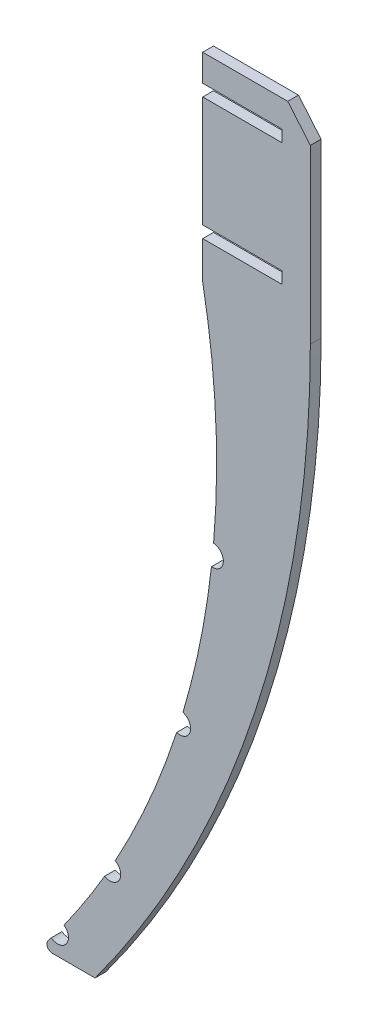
ISO-10303-21;
HEADER;
FILE_DESCRIPTION(('STEP AP214'),'2;1');
FILE_NAME('part.step','',(''),(''),'','','');
FILE_SCHEMA(('AUTOMOTIVE_DESIGN { 1 0 10303 214 1 1 1 1 }'));
ENDSEC;
DATA;
#1=APPLICATION_CONTEXT('core data for automotive mechanical design processes');
#2=APPLICATION_PROTOCOL_DEFINITION('international standard','automotive_design',2000,#1);
#3=PRODUCT_CONTEXT('',#1,'mechanical');
#4=PRODUCT('Part','Part','',(#3));
#5=PRODUCT_RELATED_PRODUCT_CATEGORY('part','',(#4));
#6=PRODUCT_DEFINITION_FORMATION('','',#4);
#7=PRODUCT_DEFINITION_CONTEXT('part definition',#1,'design');
#8=PRODUCT_DEFINITION('design','',#6,#7);
#9=PRODUCT_DEFINITION_SHAPE('','',#8);
#10=(LENGTH_UNIT() NAMED_UNIT(*) SI_UNIT(.MILLI.,.METRE.));
#11=(NAMED_UNIT(*) PLANE_ANGLE_UNIT() SI_UNIT($,.RADIAN.));
#12=(NAMED_UNIT(*) SI_UNIT($,.STERADIAN.) SOLID_ANGLE_UNIT());
#13=UNCERTAINTY_MEASURE_WITH_UNIT(LENGTH_MEASURE(1.E-05),#10,'distance_accuracy_value','');
#14=(GEOMETRIC_REPRESENTATION_CONTEXT(3) GLOBAL_UNCERTAINTY_ASSIGNED_CONTEXT((#13)) GLOBAL_UNIT_ASSIGNED_CONTEXT((#10,
#11,#12)) REPRESENTATION_CONTEXT('',''));
#15=CARTESIAN_POINT('',(0.,0.,0.));
#16=DIRECTION('',(0.,0.,1.));
#17=DIRECTION('',(1.,0.,0.));
#18=AXIS2_PLACEMENT_3D('',#15,#16,#17);
#19=CARTESIAN_POINT('',(-20.,-156.8,1.5));
#20=DIRECTION('',(0.,1.,0.));
#21=DIRECTION('',(1.,0.,0.));
#22=AXIS2_PLACEMENT_3D('',#19,#20,#21);
#23=PLANE('',#22);
#24=DIRECTION('',(0.,0.,1.));
#25=VECTOR('',#24,1.);
#26=CARTESIAN_POINT('',(-27.9577727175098,-156.8,1.5));
#27=LINE('',#26,#25);
#28=CARTESIAN_POINT('',(-27.9577727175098,-156.8,-0.5));
#29=VERTEX_POINT('',#28);
#30=CARTESIAN_POINT('',(-27.9577727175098,-156.8,1.5));
#31=VERTEX_POINT('',#30);
#32=EDGE_CURVE('E11',#29,#31,#27,.T.);
#33=ORIENTED_EDGE('',*,*,#32,.F.);
#34=DIRECTION('',(-1.,0.,0.));
#35=VECTOR('',#34,1.);
#36=CARTESIAN_POINT('',(-186.050000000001,-156.8,-0.5));
#37=LINE('',#36,#35);
#38=CARTESIAN_POINT('',(-20.,-156.8,-0.5));
#39=VERTEX_POINT('',#38);
#40=EDGE_CURVE('E149',#29,#39,#37,.F.);
#41=ORIENTED_EDGE('',*,*,#40,.T.);
#42=DIRECTION('',(0.,0.,1.));
#43=VECTOR('',#42,1.);
#44=CARTESIAN_POINT('',(-20.,-156.8,1.5));
#45=LINE('',#44,#43);
#46=CARTESIAN_POINT('',(-20.,-156.8,1.5));
#47=VERTEX_POINT('',#46);
#48=EDGE_CURVE('E44',#39,#47,#45,.T.);
#49=ORIENTED_EDGE('',*,*,#48,.T.);
#50=DIRECTION('',(1.,0.,0.));
#51=VECTOR('',#50,1.);
#52=CARTESIAN_POINT('',(-20.,-156.8,1.5));
#53=LINE('',#52,#51);
#54=EDGE_CURVE('E284',#31,#47,#53,.T.);
#55=ORIENTED_EDGE('',*,*,#54,.F.);
#56=EDGE_LOOP('',(#33,#41,#49,#55));
#57=FACE_BOUND('',#56,.T.);
#58=ADVANCED_FACE('F34',(#57),#23,.F.);
#59=CARTESIAN_POINT('',(-186.050000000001,-34.8,1.5));
#60=DIRECTION('',(0.,0.,1.));
#61=DIRECTION('',(1.,0.,0.));
#62=AXIS2_PLACEMENT_3D('',#59,#60,#61);
#63=CYLINDRICAL_SURFACE('',#62,206.05);
#64=ORIENTED_EDGE('',*,*,#48,.F.);
#65=CARTESIAN_POINT('',(-186.050000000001,-34.8,-0.5));
#66=DIRECTION('',(0.,0.,1.));
#67=DIRECTION('',(1.,0.,0.));
#68=AXIS2_PLACEMENT_3D('',#65,#66,#67);
#69=CIRCLE('',#68,206.05);
#70=CARTESIAN_POINT('',(19.9999999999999,-34.7999999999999,-0.5));
#71=VERTEX_POINT('',#70);
#72=EDGE_CURVE('E216',#39,#71,#69,.T.);
#73=ORIENTED_EDGE('',*,*,#72,.T.);
#74=DIRECTION('',(0.,0.,1.));
#75=VECTOR('',#74,1.);
#76=CARTESIAN_POINT('',(19.9999999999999,-34.7999999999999,1.5));
#77=LINE('',#76,#75);
#78=CARTESIAN_POINT('',(19.9999999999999,-34.7999999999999,1.5));
#79=VERTEX_POINT('',#78);
#80=EDGE_CURVE('E277',#71,#79,#77,.T.);
#81=ORIENTED_EDGE('',*,*,#80,.T.);
#82=CARTESIAN_POINT('',(-186.050000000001,-34.8,1.5));
#83=DIRECTION('',(0.,0.,1.));
#84=DIRECTION('',(-1.,0.,0.));
#85=AXIS2_PLACEMENT_3D('',#82,#83,#84);
#86=CIRCLE('',#85,206.05);
#87=EDGE_CURVE('E293',#47,#79,#86,.T.);
#88=ORIENTED_EDGE('',*,*,#87,.F.);
#89=EDGE_LOOP('',(#64,#73,#81,#88));
#90=FACE_BOUND('',#89,.T.);
#91=ADVANCED_FACE('F296',(#90),#63,.T.);
#92=CARTESIAN_POINT('',(19.9999999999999,2.2,1.5));
#93=DIRECTION('',(-1.,0.,0.));
#94=DIRECTION('',(0.,1.,0.));
#95=AXIS2_PLACEMENT_3D('',#92,#93,#94);
#96=PLANE('',#95);
#97=ORIENTED_EDGE('',*,*,#80,.F.);
#98=DIRECTION('',(0.,1.,0.));
#99=VECTOR('',#98,1.);
#100=CARTESIAN_POINT('',(19.9999999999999,-34.8,-0.5));
#101=LINE('',#100,#99);
#102=CARTESIAN_POINT('',(19.9999999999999,-2.8,-0.5));
#103=VERTEX_POINT('',#102);
#104=EDGE_CURVE('E213',#71,#103,#101,.T.);
#105=ORIENTED_EDGE('',*,*,#104,.T.);
#106=DIRECTION('',(0.,0.,1.));
#107=VECTOR('',#106,1.);
#108=CARTESIAN_POINT('',(19.9999999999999,-2.8,1.5));
#109=LINE('',#108,#107);
#110=CARTESIAN_POINT('',(19.9999999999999,-2.8,1.5));
#111=VERTEX_POINT('',#110);
#112=EDGE_CURVE('E274',#103,#111,#109,.T.);
#113=ORIENTED_EDGE('',*,*,#112,.T.);
#114=DIRECTION('',(0.,1.,0.));
#115=VECTOR('',#114,1.);
#116=CARTESIAN_POINT('',(19.9999999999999,2.2,1.5));
#117=LINE('',#116,#115);
#118=EDGE_CURVE('E297',#79,#111,#117,.T.);
#119=ORIENTED_EDGE('',*,*,#118,.F.);
#120=EDGE_LOOP('',(#97,#105,#113,#119));
#121=FACE_BOUND('',#120,.T.);
#122=ADVANCED_FACE('F464',(#121),#96,.F.);
#123=CARTESIAN_POINT('',(15.8045018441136,2.2,1.5));
#124=DIRECTION('',(0.76604444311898,0.642787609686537,0.));
#125=DIRECTION('',(0.642787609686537,-0.76604444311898,0.));
#126=AXIS2_PLACEMENT_3D('',#123,#124,#125);
#127=PLANE('',#126);
#128=ORIENTED_EDGE('',*,*,#112,.F.);
#129=DIRECTION('',(0.642787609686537,-0.76604444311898,0.));
#130=VECTOR('',#129,1.);
#131=CARTESIAN_POINT('',(15.8045018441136,2.2,-0.5));
#132=LINE('',#131,#130);
#133=CARTESIAN_POINT('',(15.8045018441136,2.2,-0.5));
#134=VERTEX_POINT('',#133);
#135=EDGE_CURVE('E210',#103,#134,#132,.F.);
#136=ORIENTED_EDGE('',*,*,#135,.T.);
#137=DIRECTION('',(0.,0.,1.));
#138=VECTOR('',#137,1.);
#139=CARTESIAN_POINT('',(15.8045018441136,2.2,1.5));
#140=LINE('',#139,#138);
#141=CARTESIAN_POINT('',(15.8045018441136,2.2,1.5));
#142=VERTEX_POINT('',#141);
#143=EDGE_CURVE('E271',#134,#142,#140,.T.);
#144=ORIENTED_EDGE('',*,*,#143,.T.);
#145=DIRECTION('',(0.642787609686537,-0.76604444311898,0.));
#146=VECTOR('',#145,1.);
#147=CARTESIAN_POINT('',(15.8045018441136,2.2,1.5));
#148=LINE('',#147,#146);
#149=EDGE_CURVE('E299',#111,#142,#148,.F.);
#150=ORIENTED_EDGE('',*,*,#149,.F.);
#151=EDGE_LOOP('',(#128,#136,#144,#150));
#152=FACE_BOUND('',#151,.T.);
#153=ADVANCED_FACE('F460',(#152),#127,.T.);
#154=CARTESIAN_POINT('',(0.,2.2,1.5));
#155=DIRECTION('',(0.,-1.,0.));
#156=DIRECTION('',(-1.,0.,0.));
#157=AXIS2_PLACEMENT_3D('',#154,#155,#156);
#158=PLANE('',#157);
#159=ORIENTED_EDGE('',*,*,#143,.F.);
#160=DIRECTION('',(-1.,0.,0.));
#161=VECTOR('',#160,1.);
#162=CARTESIAN_POINT('',(-186.050000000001,2.2,-0.5));
#163=LINE('',#162,#161);
#164=CARTESIAN_POINT('',(0.,2.2,-0.5));
#165=VERTEX_POINT('',#164);
#166=EDGE_CURVE('E207',#134,#165,#163,.T.);
#167=ORIENTED_EDGE('',*,*,#166,.T.);
#168=DIRECTION('',(0.,0.,1.));
#169=VECTOR('',#168,1.);
#170=CARTESIAN_POINT('',(0.,2.2,1.5));
#171=LINE('',#170,#169);
#172=CARTESIAN_POINT('',(0.,2.2,1.5));
#173=VERTEX_POINT('',#172);
#174=EDGE_CURVE('E268',#165,#173,#171,.T.);
#175=ORIENTED_EDGE('',*,*,#174,.T.);
#176=DIRECTION('',(-1.,0.,0.));
#177=VECTOR('',#176,1.);
#178=CARTESIAN_POINT('',(0.,2.2,1.5));
#179=LINE('',#178,#177);
#180=EDGE_CURVE('E305',#142,#173,#179,.T.);
#181=ORIENTED_EDGE('',*,*,#180,.F.);
#182=EDGE_LOOP('',(#159,#167,#175,#181));
#183=FACE_BOUND('',#182,.T.);
#184=ADVANCED_FACE('F457',(#183),#158,.F.);
#185=CARTESIAN_POINT('',(0.,-2.8,1.5));
#186=DIRECTION('',(1.,0.,0.));
#187=DIRECTION('',(0.,-1.,0.));
#188=AXIS2_PLACEMENT_3D('',#185,#186,#187);
#189=PLANE('',#188);
#190=ORIENTED_EDGE('',*,*,#174,.F.);
#191=DIRECTION('',(0.,1.,0.));
#192=VECTOR('',#191,1.);
#193=CARTESIAN_POINT('',(0.,-34.8,-0.5));
#194=LINE('',#193,#192);
#195=CARTESIAN_POINT('',(0.,-2.8,-0.5));
#196=VERTEX_POINT('',#195);
#197=EDGE_CURVE('E204',#165,#196,#194,.F.);
#198=ORIENTED_EDGE('',*,*,#197,.T.);
#199=DIRECTION('',(0.,0.,1.));
#200=VECTOR('',#199,1.);
#201=CARTESIAN_POINT('',(0.,-2.8,1.5));
#202=LINE('',#201,#200);
#203=CARTESIAN_POINT('',(0.,-2.8,1.5));
#204=VERTEX_POINT('',#203);
#205=EDGE_CURVE('E265',#196,#204,#202,.T.);
#206=ORIENTED_EDGE('',*,*,#205,.T.);
#207=DIRECTION('',(0.,-1.,0.));
#208=VECTOR('',#207,1.);
#209=CARTESIAN_POINT('',(0.,-2.8,1.5));
#210=LINE('',#209,#208);
#211=EDGE_CURVE('E308',#173,#204,#210,.T.);
#212=ORIENTED_EDGE('',*,*,#211,.F.);
#213=EDGE_LOOP('',(#190,#198,#206,#212));
#214=FACE_BOUND('',#213,.T.);
#215=ADVANCED_FACE('F454',(#214),#189,.F.);
#216=CARTESIAN_POINT('',(0.,-2.8,1.5));
#217=DIRECTION('',(0.,1.,0.));
#218=DIRECTION('',(1.,0.,0.));
#219=AXIS2_PLACEMENT_3D('',#216,#217,#218);
#220=PLANE('',#219);
#221=ORIENTED_EDGE('',*,*,#205,.F.);
#222=DIRECTION('',(-1.,0.,0.));
#223=VECTOR('',#222,1.);
#224=CARTESIAN_POINT('',(-186.050000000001,-2.8,-0.5));
#225=LINE('',#224,#223);
#226=CARTESIAN_POINT('',(14.77,-2.8,-0.5));
#227=VERTEX_POINT('',#226);
#228=EDGE_CURVE('E201',#196,#227,#225,.F.);
#229=ORIENTED_EDGE('',*,*,#228,.T.);
#230=DIRECTION('',(0.,0.,1.));
#231=VECTOR('',#230,1.);
#232=CARTESIAN_POINT('',(14.77,-2.8,1.5));
#233=LINE('',#232,#231);
#234=CARTESIAN_POINT('',(14.77,-2.8,1.5));
#235=VERTEX_POINT('',#234);
#236=EDGE_CURVE('E262',#227,#235,#233,.T.);
#237=ORIENTED_EDGE('',*,*,#236,.T.);
#238=DIRECTION('',(1.,0.,0.));
#239=VECTOR('',#238,1.);
#240=CARTESIAN_POINT('',(0.,-2.8,1.5));
#241=LINE('',#240,#239);
#242=EDGE_CURVE('E311',#204,#235,#241,.T.);
#243=ORIENTED_EDGE('',*,*,#242,.F.);
#244=EDGE_LOOP('',(#221,#229,#237,#243));
#245=FACE_BOUND('',#244,.T.);
#246=ADVANCED_FACE('F449',(#245),#220,.F.);
#247=CARTESIAN_POINT('',(14.77,-2.8,1.5));
#248=DIRECTION('',(1.,0.,0.));
#249=DIRECTION('',(0.,-1.,0.));
#250=AXIS2_PLACEMENT_3D('',#247,#248,#249);
#251=PLANE('',#250);
#252=ORIENTED_EDGE('',*,*,#236,.F.);
#253=DIRECTION('',(0.,1.,0.));
#254=VECTOR('',#253,1.);
#255=CARTESIAN_POINT('',(14.77,-34.8,-0.5));
#256=LINE('',#255,#254);
#257=CARTESIAN_POINT('',(14.77,-5.,-0.5));
#258=VERTEX_POINT('',#257);
#259=EDGE_CURVE('E198',#227,#258,#256,.F.);
#260=ORIENTED_EDGE('',*,*,#259,.T.);
#261=DIRECTION('',(0.,0.,1.));
#262=VECTOR('',#261,1.);
#263=CARTESIAN_POINT('',(14.77,-5.,1.5));
#264=LINE('',#263,#262);
#265=CARTESIAN_POINT('',(14.77,-5.,1.5));
#266=VERTEX_POINT('',#265);
#267=EDGE_CURVE('E259',#258,#266,#264,.T.);
#268=ORIENTED_EDGE('',*,*,#267,.T.);
#269=DIRECTION('',(0.,-1.,0.));
#270=VECTOR('',#269,1.);
#271=CARTESIAN_POINT('',(14.77,-2.8,1.5));
#272=LINE('',#271,#270);
#273=EDGE_CURVE('E314',#235,#266,#272,.T.);
#274=ORIENTED_EDGE('',*,*,#273,.F.);
#275=EDGE_LOOP('',(#252,#260,#268,#274));
#276=FACE_BOUND('',#275,.T.);
#277=ADVANCED_FACE('F445',(#276),#251,.F.);
#278=CARTESIAN_POINT('',(0.,-5.,1.5));
#279=DIRECTION('',(0.,-1.,0.));
#280=DIRECTION('',(-1.,0.,0.));
#281=AXIS2_PLACEMENT_3D('',#278,#279,#280);
#282=PLANE('',#281);
#283=ORIENTED_EDGE('',*,*,#267,.F.);
#284=DIRECTION('',(-1.,0.,0.));
#285=VECTOR('',#284,1.);
#286=CARTESIAN_POINT('',(-186.050000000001,-5.,-0.5));
#287=LINE('',#286,#285);
#288=CARTESIAN_POINT('',(0.,-5.,-0.5));
#289=VERTEX_POINT('',#288);
#290=EDGE_CURVE('E195',#258,#289,#287,.T.);
#291=ORIENTED_EDGE('',*,*,#290,.T.);
#292=DIRECTION('',(0.,0.,1.));
#293=VECTOR('',#292,1.);
#294=CARTESIAN_POINT('',(0.,-5.,1.5));
#295=LINE('',#294,#293);
#296=CARTESIAN_POINT('',(0.,-5.,1.5));
#297=VERTEX_POINT('',#296);
#298=EDGE_CURVE('E256',#289,#297,#295,.T.);
#299=ORIENTED_EDGE('',*,*,#298,.T.);
#300=DIRECTION('',(-1.,0.,0.));
#301=VECTOR('',#300,1.);
#302=CARTESIAN_POINT('',(0.,-5.,1.5));
#303=LINE('',#302,#301);
#304=EDGE_CURVE('E317',#266,#297,#303,.T.);
#305=ORIENTED_EDGE('',*,*,#304,.F.);
#306=EDGE_LOOP('',(#283,#291,#299,#305));
#307=FACE_BOUND('',#306,.T.);
#308=ADVANCED_FACE('F442',(#307),#282,.F.);
#309=CARTESIAN_POINT('',(0.,-5.,1.5));
#310=DIRECTION('',(1.,0.,0.));
#311=DIRECTION('',(0.,-1.,0.));
#312=AXIS2_PLACEMENT_3D('',#309,#310,#311);
#313=PLANE('',#312);
#314=ORIENTED_EDGE('',*,*,#298,.F.);
#315=DIRECTION('',(0.,1.,0.));
#316=VECTOR('',#315,1.);
#317=CARTESIAN_POINT('',(0.,-34.8,-0.5));
#318=LINE('',#317,#316);
#319=CARTESIAN_POINT('',(0.,-25.6,-0.5));
#320=VERTEX_POINT('',#319);
#321=EDGE_CURVE('E192',#289,#320,#318,.F.);
#322=ORIENTED_EDGE('',*,*,#321,.T.);
#323=DIRECTION('',(0.,0.,1.));
#324=VECTOR('',#323,1.);
#325=CARTESIAN_POINT('',(0.,-25.6,1.5));
#326=LINE('',#325,#324);
#327=CARTESIAN_POINT('',(0.,-25.6,1.5));
#328=VERTEX_POINT('',#327);
#329=EDGE_CURVE('E253',#320,#328,#326,.T.);
#330=ORIENTED_EDGE('',*,*,#329,.T.);
#331=DIRECTION('',(0.,-1.,0.));
#332=VECTOR('',#331,1.);
#333=CARTESIAN_POINT('',(0.,-5.,1.5));
#334=LINE('',#333,#332);
#335=EDGE_CURVE('E320',#297,#328,#334,.T.);
#336=ORIENTED_EDGE('',*,*,#335,.F.);
#337=EDGE_LOOP('',(#314,#322,#330,#336));
#338=FACE_BOUND('',#337,.T.);
#339=ADVANCED_FACE('F437',(#338),#313,.F.);
#340=CARTESIAN_POINT('',(0.,-25.6,1.5));
#341=DIRECTION('',(0.,1.,0.));
#342=DIRECTION('',(1.,0.,0.));
#343=AXIS2_PLACEMENT_3D('',#340,#341,#342);
#344=PLANE('',#343);
#345=ORIENTED_EDGE('',*,*,#329,.F.);
#346=DIRECTION('',(-1.,0.,0.));
#347=VECTOR('',#346,1.);
#348=CARTESIAN_POINT('',(-186.050000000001,-25.6,-0.5));
#349=LINE('',#348,#347);
#350=CARTESIAN_POINT('',(14.77,-25.6,-0.5));
#351=VERTEX_POINT('',#350);
#352=EDGE_CURVE('E189',#320,#351,#349,.F.);
#353=ORIENTED_EDGE('',*,*,#352,.T.);
#354=DIRECTION('',(0.,0.,1.));
#355=VECTOR('',#354,1.);
#356=CARTESIAN_POINT('',(14.77,-25.6,1.5));
#357=LINE('',#356,#355);
#358=CARTESIAN_POINT('',(14.77,-25.6,1.5));
#359=VERTEX_POINT('',#358);
#360=EDGE_CURVE('E250',#351,#359,#357,.T.);
#361=ORIENTED_EDGE('',*,*,#360,.T.);
#362=DIRECTION('',(1.,0.,0.));
#363=VECTOR('',#362,1.);
#364=CARTESIAN_POINT('',(0.,-25.6,1.5));
#365=LINE('',#364,#363);
#366=EDGE_CURVE('E323',#328,#359,#365,.T.);
#367=ORIENTED_EDGE('',*,*,#366,.F.);
#368=EDGE_LOOP('',(#345,#353,#361,#367));
#369=FACE_BOUND('',#368,.T.);
#370=ADVANCED_FACE('F433',(#369),#344,.F.);
#371=CARTESIAN_POINT('',(14.77,-25.6,1.5));
#372=DIRECTION('',(1.,0.,0.));
#373=DIRECTION('',(0.,-1.,0.));
#374=AXIS2_PLACEMENT_3D('',#371,#372,#373);
#375=PLANE('',#374);
#376=ORIENTED_EDGE('',*,*,#360,.F.);
#377=DIRECTION('',(0.,1.,0.));
#378=VECTOR('',#377,1.);
#379=CARTESIAN_POINT('',(14.77,-34.8,-0.5));
#380=LINE('',#379,#378);
#381=CARTESIAN_POINT('',(14.77,-27.8,-0.5));
#382=VERTEX_POINT('',#381);
#383=EDGE_CURVE('E186',#351,#382,#380,.F.);
#384=ORIENTED_EDGE('',*,*,#383,.T.);
#385=DIRECTION('',(0.,0.,1.));
#386=VECTOR('',#385,1.);
#387=CARTESIAN_POINT('',(14.77,-27.8,1.5));
#388=LINE('',#387,#386);
#389=CARTESIAN_POINT('',(14.77,-27.8,1.5));
#390=VERTEX_POINT('',#389);
#391=EDGE_CURVE('E247',#382,#390,#388,.T.);
#392=ORIENTED_EDGE('',*,*,#391,.T.);
#393=DIRECTION('',(0.,-1.,0.));
#394=VECTOR('',#393,1.);
#395=CARTESIAN_POINT('',(14.77,-25.6,1.5));
#396=LINE('',#395,#394);
#397=EDGE_CURVE('E326',#359,#390,#396,.T.);
#398=ORIENTED_EDGE('',*,*,#397,.F.);
#399=EDGE_LOOP('',(#376,#384,#392,#398));
#400=FACE_BOUND('',#399,.T.);
#401=ADVANCED_FACE('F430',(#400),#375,.F.);
#402=CARTESIAN_POINT('',(0.,-27.8,1.5));
#403=DIRECTION('',(0.,-1.,0.));
#404=DIRECTION('',(-1.,0.,0.));
#405=AXIS2_PLACEMENT_3D('',#402,#403,#404);
#406=PLANE('',#405);
#407=ORIENTED_EDGE('',*,*,#391,.F.);
#408=DIRECTION('',(-1.,0.,0.));
#409=VECTOR('',#408,1.);
#410=CARTESIAN_POINT('',(-186.050000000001,-27.8,-0.5));
#411=LINE('',#410,#409);
#412=CARTESIAN_POINT('',(0.,-27.8,-0.5));
#413=VERTEX_POINT('',#412);
#414=EDGE_CURVE('E183',#382,#413,#411,.T.);
#415=ORIENTED_EDGE('',*,*,#414,.T.);
#416=DIRECTION('',(0.,0.,1.));
#417=VECTOR('',#416,1.);
#418=CARTESIAN_POINT('',(0.,-27.8,1.5));
#419=LINE('',#418,#417);
#420=CARTESIAN_POINT('',(0.,-27.8,1.5));
#421=VERTEX_POINT('',#420);
#422=EDGE_CURVE('E244',#413,#421,#419,.T.);
#423=ORIENTED_EDGE('',*,*,#422,.T.);
#424=DIRECTION('',(-1.,0.,0.));
#425=VECTOR('',#424,1.);
#426=CARTESIAN_POINT('',(0.,-27.8,1.5));
#427=LINE('',#426,#425);
#428=EDGE_CURVE('E329',#390,#421,#427,.T.);
#429=ORIENTED_EDGE('',*,*,#428,.F.);
#430=EDGE_LOOP('',(#407,#415,#423,#429));
#431=FACE_BOUND('',#430,.T.);
#432=ADVANCED_FACE('F425',(#431),#406,.F.);
#433=CARTESIAN_POINT('',(0.,-27.8,1.5));
#434=DIRECTION('',(1.,0.,0.));
#435=DIRECTION('',(0.,-1.,0.));
#436=AXIS2_PLACEMENT_3D('',#433,#434,#435);
#437=PLANE('',#436);
#438=ORIENTED_EDGE('',*,*,#422,.F.);
#439=DIRECTION('',(0.,1.,0.));
#440=VECTOR('',#439,1.);
#441=CARTESIAN_POINT('',(0.,-34.8,-0.5));
#442=LINE('',#441,#440);
#443=CARTESIAN_POINT('',(0.,-34.8,-0.5));
#444=VERTEX_POINT('',#443);
#445=EDGE_CURVE('E180',#413,#444,#442,.F.);
#446=ORIENTED_EDGE('',*,*,#445,.T.);
#447=DIRECTION('',(0.,0.,1.));
#448=VECTOR('',#447,1.);
#449=CARTESIAN_POINT('',(0.,-34.8,1.5));
#450=LINE('',#449,#448);
#451=CARTESIAN_POINT('',(0.,-34.8,1.5));
#452=VERTEX_POINT('',#451);
#453=EDGE_CURVE('E241',#444,#452,#450,.T.);
#454=ORIENTED_EDGE('',*,*,#453,.T.);
#455=DIRECTION('',(0.,-1.,0.));
#456=VECTOR('',#455,1.);
#457=CARTESIAN_POINT('',(0.,-27.8,1.5));
#458=LINE('',#457,#456);
#459=EDGE_CURVE('E332',#421,#452,#458,.T.);
#460=ORIENTED_EDGE('',*,*,#459,.F.);
#461=EDGE_LOOP('',(#438,#446,#454,#460));
#462=FACE_BOUND('',#461,.T.);
#463=ADVANCED_FACE('F421',(#462),#437,.F.);
#464=CARTESIAN_POINT('',(-149.53282032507,-62.7181589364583,1.5));
#465=DIRECTION('',(0.,0.,-1.));
#466=DIRECTION('',(-1.,0.,0.));
#467=AXIS2_PLACEMENT_3D('',#464,#465,#466);
#468=CYLINDRICAL_SURFACE('',#467,152.11669189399);
#469=ORIENTED_EDGE('',*,*,#453,.F.);
#470=CARTESIAN_POINT('',(-149.53282032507,-62.7181589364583,-0.5));
#471=DIRECTION('',(0.,0.,-1.));
#472=DIRECTION('',(-1.,0.,0.));
#473=AXIS2_PLACEMENT_3D('',#470,#471,#472);
#474=CIRCLE('',#473,152.11669189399);
#475=CARTESIAN_POINT('',(2.01957480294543,-75.8085937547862,-0.5));
#476=VERTEX_POINT('',#475);
#477=EDGE_CURVE('E177',#444,#476,#474,.T.);
#478=ORIENTED_EDGE('',*,*,#477,.T.);
#479=DIRECTION('',(0.,0.,1.));
#480=VECTOR('',#479,1.);
#481=CARTESIAN_POINT('',(2.01957480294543,-75.8085937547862,1.5));
#482=LINE('',#481,#480);
#483=CARTESIAN_POINT('',(2.01957480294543,-75.8085937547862,1.5));
#484=VERTEX_POINT('',#483);
#485=EDGE_CURVE('E238',#476,#484,#482,.T.);
#486=ORIENTED_EDGE('',*,*,#485,.T.);
#487=CARTESIAN_POINT('',(-149.53282032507,-62.7181589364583,1.5));
#488=DIRECTION('',(0.,0.,-1.));
#489=DIRECTION('',(-1.,0.,0.));
#490=AXIS2_PLACEMENT_3D('',#487,#488,#489);
#491=CIRCLE('',#490,152.11669189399);
#492=EDGE_CURVE('E335',#452,#484,#491,.T.);
#493=ORIENTED_EDGE('',*,*,#492,.F.);
#494=EDGE_LOOP('',(#469,#478,#486,#493));
#495=FACE_BOUND('',#494,.T.);
#496=ADVANCED_FACE('F418',(#495),#468,.F.);
#497=CARTESIAN_POINT('',(1.83436906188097,-77.8,1.5));
#498=DIRECTION('',(0.,0.,1.));
#499=DIRECTION('',(1.,0.,0.));
#500=AXIS2_PLACEMENT_3D('',#497,#498,#499);
#501=CYLINDRICAL_SURFACE('',#500,2.);
#502=ORIENTED_EDGE('',*,*,#485,.F.);
#503=CARTESIAN_POINT('',(1.83436906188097,-77.8,-0.5));
#504=DIRECTION('',(0.,0.,1.));
#505=DIRECTION('',(1.,0.,0.));
#506=AXIS2_PLACEMENT_3D('',#503,#504,#505);
#507=CIRCLE('',#506,2.);
#508=CARTESIAN_POINT('',(1.62299728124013,-79.7887991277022,-0.5));
#509=VERTEX_POINT('',#508);
#510=EDGE_CURVE('E174',#509,#476,#507,.T.);
#511=ORIENTED_EDGE('',*,*,#510,.F.);
#512=DIRECTION('',(0.,0.,1.));
#513=VECTOR('',#512,1.);
#514=CARTESIAN_POINT('',(1.62299728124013,-79.7887991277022,1.5));
#515=LINE('',#514,#513);
#516=CARTESIAN_POINT('',(1.62299728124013,-79.7887991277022,1.5));
#517=VERTEX_POINT('',#516);
#518=EDGE_CURVE('E235',#509,#517,#515,.T.);
#519=ORIENTED_EDGE('',*,*,#518,.T.);
#520=CARTESIAN_POINT('',(1.83436906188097,-77.8,1.5));
#521=DIRECTION('',(0.,0.,1.));
#522=DIRECTION('',(1.,0.,0.));
#523=AXIS2_PLACEMENT_3D('',#520,#521,#522);
#524=CIRCLE('',#523,2.);
#525=EDGE_CURVE('E336',#517,#484,#524,.T.);
#526=ORIENTED_EDGE('',*,*,#525,.T.);
#527=EDGE_LOOP('',(#502,#511,#519,#526));
#528=FACE_BOUND('',#527,.T.);
#529=ADVANCED_FACE('F414',(#528),#501,.F.);
#530=ORIENTED_EDGE('',*,*,#518,.F.);
#531=CARTESIAN_POINT('',(-149.53282032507,-62.7181589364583,-0.5));
#532=DIRECTION('',(0.,0.,-1.));
#533=DIRECTION('',(-1.,0.,0.));
#534=AXIS2_PLACEMENT_3D('',#531,#532,#533);
#535=CIRCLE('',#534,152.11669189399);
#536=CARTESIAN_POINT('',(-3.66978203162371,-105.885994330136,-0.5));
#537=VERTEX_POINT('',#536);
#538=EDGE_CURVE('E171',#509,#537,#535,.T.);
#539=ORIENTED_EDGE('',*,*,#538,.T.);
#540=DIRECTION('',(0.,0.,1.));
#541=VECTOR('',#540,1.);
#542=CARTESIAN_POINT('',(-3.66978203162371,-105.885994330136,1.5));
#543=LINE('',#542,#541);
#544=CARTESIAN_POINT('',(-3.66978203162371,-105.885994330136,1.5));
#545=VERTEX_POINT('',#544);
#546=EDGE_CURVE('E232',#537,#545,#543,.T.);
#547=ORIENTED_EDGE('',*,*,#546,.T.);
#548=EDGE_CURVE('E339',#517,#545,#491,.T.);
#549=ORIENTED_EDGE('',*,*,#548,.F.);
#550=EDGE_LOOP('',(#530,#539,#547,#549));
#551=FACE_BOUND('',#550,.T.);
#552=ADVANCED_FACE('F412',(#551),#468,.F.);
#553=CARTESIAN_POINT('',(-4.24993916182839,-107.8,1.5));
#554=DIRECTION('',(0.,0.,1.));
#555=DIRECTION('',(1.,0.,0.));
#556=AXIS2_PLACEMENT_3D('',#553,#554,#555);
#557=CYLINDRICAL_SURFACE('',#556,2.);
#558=ORIENTED_EDGE('',*,*,#546,.F.);
#559=CARTESIAN_POINT('',(-4.24993916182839,-107.8,-0.5));
#560=DIRECTION('',(0.,0.,1.));
#561=DIRECTION('',(1.,0.,0.));
#562=AXIS2_PLACEMENT_3D('',#559,#560,#561);
#563=CIRCLE('',#562,2.);
#564=CARTESIAN_POINT('',(-4.85521056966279,-109.706212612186,-0.5));
#565=VERTEX_POINT('',#564);
#566=EDGE_CURVE('E168',#565,#537,#563,.T.);
#567=ORIENTED_EDGE('',*,*,#566,.F.);
#568=DIRECTION('',(0.,0.,1.));
#569=VECTOR('',#568,1.);
#570=CARTESIAN_POINT('',(-4.85521056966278,-109.706212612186,1.5));
#571=LINE('',#570,#569);
#572=CARTESIAN_POINT('',(-4.85521056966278,-109.706212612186,1.5));
#573=VERTEX_POINT('',#572);
#574=EDGE_CURVE('E229',#565,#573,#571,.T.);
#575=ORIENTED_EDGE('',*,*,#574,.T.);
#576=CARTESIAN_POINT('',(-4.24993916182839,-107.8,1.5));
#577=DIRECTION('',(0.,0.,1.));
#578=DIRECTION('',(1.,0.,0.));
#579=AXIS2_PLACEMENT_3D('',#576,#577,#578);
#580=CIRCLE('',#579,2.);
#581=EDGE_CURVE('E340',#573,#545,#580,.T.);
#582=ORIENTED_EDGE('',*,*,#581,.T.);
#583=EDGE_LOOP('',(#558,#567,#575,#582));
#584=FACE_BOUND('',#583,.T.);
#585=ADVANCED_FACE('F408',(#584),#557,.F.);
#586=ORIENTED_EDGE('',*,*,#574,.F.);
#587=CARTESIAN_POINT('',(-149.53282032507,-62.7181589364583,-0.5));
#588=DIRECTION('',(0.,0.,-1.));
#589=DIRECTION('',(-1.,0.,0.));
#590=AXIS2_PLACEMENT_3D('',#587,#588,#589);
#591=CIRCLE('',#590,152.11669189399);
#592=CARTESIAN_POINT('',(-16.2612154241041,-136.054147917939,-0.5));
#593=VERTEX_POINT('',#592);
#594=EDGE_CURVE('E165',#565,#593,#591,.T.);
#595=ORIENTED_EDGE('',*,*,#594,.T.);
#596=DIRECTION('',(0.,0.,1.));
#597=VECTOR('',#596,1.);
#598=CARTESIAN_POINT('',(-16.2612154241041,-136.054147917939,1.5));
#599=LINE('',#598,#597);
#600=CARTESIAN_POINT('',(-16.2612154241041,-136.054147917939,1.5));
#601=VERTEX_POINT('',#600);
#602=EDGE_CURVE('E226',#593,#601,#599,.T.);
#603=ORIENTED_EDGE('',*,*,#602,.T.);
#604=EDGE_CURVE('E342',#573,#601,#491,.T.);
#605=ORIENTED_EDGE('',*,*,#604,.F.);
#606=EDGE_LOOP('',(#586,#595,#603,#605));
#607=FACE_BOUND('',#606,.T.);
#608=ADVANCED_FACE('F406',(#607),#468,.F.);
#609=CARTESIAN_POINT('',(-17.2369205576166,-137.8,1.5));
#610=DIRECTION('',(0.,0.,1.));
#611=DIRECTION('',(1.,0.,0.));
#612=AXIS2_PLACEMENT_3D('',#609,#610,#611);
#613=CYLINDRICAL_SURFACE('',#612,2.);
#614=ORIENTED_EDGE('',*,*,#602,.F.);
#615=CARTESIAN_POINT('',(-17.2369205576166,-137.8,-0.5));
#616=DIRECTION('',(0.,0.,1.));
#617=DIRECTION('',(1.,0.,0.));
#618=AXIS2_PLACEMENT_3D('',#615,#616,#617);
#619=CIRCLE('',#618,2.);
#620=CARTESIAN_POINT('',(-18.2354949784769,-139.532873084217,-0.5));
#621=VERTEX_POINT('',#620);
#622=EDGE_CURVE('E162',#621,#593,#619,.T.);
#623=ORIENTED_EDGE('',*,*,#622,.F.);
#624=DIRECTION('',(0.,0.,1.));
#625=VECTOR('',#624,1.);
#626=CARTESIAN_POINT('',(-18.2354949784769,-139.532873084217,1.5));
#627=LINE('',#626,#625);
#628=CARTESIAN_POINT('',(-18.2354949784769,-139.532873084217,1.5));
#629=VERTEX_POINT('',#628);
#630=EDGE_CURVE('E223',#621,#629,#627,.T.);
#631=ORIENTED_EDGE('',*,*,#630,.T.);
#632=CARTESIAN_POINT('',(-17.2369205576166,-137.8,1.5));
#633=DIRECTION('',(0.,0.,1.));
#634=DIRECTION('',(1.,0.,0.));
#635=AXIS2_PLACEMENT_3D('',#632,#633,#634);
#636=CIRCLE('',#635,2.);
#637=EDGE_CURVE('E343',#629,#601,#636,.T.);
#638=ORIENTED_EDGE('',*,*,#637,.T.);
#639=EDGE_LOOP('',(#614,#623,#631,#638));
#640=FACE_BOUND('',#639,.T.);
#641=ADVANCED_FACE('F397',(#640),#613,.F.);
#642=ORIENTED_EDGE('',*,*,#630,.F.);
#643=CARTESIAN_POINT('',(-149.53282032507,-62.7181589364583,-0.5));
#644=DIRECTION('',(0.,0.,-1.));
#645=DIRECTION('',(-1.,0.,0.));
#646=AXIS2_PLACEMENT_3D('',#643,#644,#645);
#647=CIRCLE('',#646,152.11669189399);
#648=CARTESIAN_POINT('',(-25.7835758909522,-151.18065073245,-0.5));
#649=VERTEX_POINT('',#648);
#650=EDGE_CURVE('E159',#621,#649,#647,.T.);
#651=ORIENTED_EDGE('',*,*,#650,.T.);
#652=DIRECTION('',(0.,0.,1.));
#653=VECTOR('',#652,1.);
#654=CARTESIAN_POINT('',(-25.7835758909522,-151.18065073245,1.5));
#655=LINE('',#654,#653);
#656=CARTESIAN_POINT('',(-25.7835758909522,-151.18065073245,1.5));
#657=VERTEX_POINT('',#656);
#658=EDGE_CURVE('E221',#649,#657,#655,.T.);
#659=ORIENTED_EDGE('',*,*,#658,.T.);
#660=EDGE_CURVE('E345',#629,#657,#491,.T.);
#661=ORIENTED_EDGE('',*,*,#660,.F.);
#662=EDGE_LOOP('',(#642,#651,#659,#661));
#663=FACE_BOUND('',#662,.T.);
#664=ADVANCED_FACE('F401',(#663),#468,.F.);
#665=CARTESIAN_POINT('',(-26.9573339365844,-152.8,1.5));
#666=DIRECTION('',(0.,0.,1.));
#667=DIRECTION('',(1.,0.,0.));
#668=AXIS2_PLACEMENT_3D('',#665,#666,#667);
#669=CYLINDRICAL_SURFACE('',#668,2.);
#670=ORIENTED_EDGE('',*,*,#658,.F.);
#671=CARTESIAN_POINT('',(-26.9573339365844,-152.8,-0.5));
#672=DIRECTION('',(0.,0.,1.));
#673=DIRECTION('',(1.,0.,0.));
#674=AXIS2_PLACEMENT_3D('',#671,#672,#673);
#675=CIRCLE('',#674,2.);
#676=CARTESIAN_POINT('',(-28.1522809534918,-154.403777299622,-0.5));
#677=VERTEX_POINT('',#676);
#678=EDGE_CURVE('E156',#677,#649,#675,.T.);
#679=ORIENTED_EDGE('',*,*,#678,.F.);
#680=DIRECTION('',(0.,0.,1.));
#681=VECTOR('',#680,1.);
#682=CARTESIAN_POINT('',(-28.1522809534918,-154.403777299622,1.5));
#683=LINE('',#682,#681);
#684=CARTESIAN_POINT('',(-28.1522809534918,-154.403777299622,1.5));
#685=VERTEX_POINT('',#684);
#686=EDGE_CURVE('E52',#677,#685,#683,.T.);
#687=ORIENTED_EDGE('',*,*,#686,.T.);
#688=CARTESIAN_POINT('',(-26.9573339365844,-152.8,1.5));
#689=DIRECTION('',(0.,0.,1.));
#690=DIRECTION('',(1.,0.,0.));
#691=AXIS2_PLACEMENT_3D('',#688,#689,#690);
#692=CIRCLE('',#691,2.);
#693=EDGE_CURVE('E142',#685,#657,#692,.T.);
#694=ORIENTED_EDGE('',*,*,#693,.T.);
#695=EDGE_LOOP('',(#670,#679,#687,#694));
#696=FACE_BOUND('',#695,.T.);
#697=ADVANCED_FACE('F402',(#696),#669,.F.);
#698=ORIENTED_EDGE('',*,*,#686,.F.);
#699=CARTESIAN_POINT('',(-149.53282032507,-62.7181589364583,-0.5));
#700=DIRECTION('',(0.,0.,-1.));
#701=DIRECTION('',(-1.,0.,0.));
#702=AXIS2_PLACEMENT_3D('',#699,#700,#701);
#703=CIRCLE('',#702,152.11669189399);
#704=CARTESIAN_POINT('',(-28.7517752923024,-155.19208560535,-0.5));
#705=VERTEX_POINT('',#704);
#706=EDGE_CURVE('E147',#677,#705,#703,.T.);
#707=ORIENTED_EDGE('',*,*,#706,.T.);
#708=DIRECTION('',(0.,0.,1.));
#709=VECTOR('',#708,1.);
#710=CARTESIAN_POINT('',(-28.7517752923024,-155.19208560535,1.5));
#711=LINE('',#710,#709);
#712=CARTESIAN_POINT('',(-28.7517752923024,-155.19208560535,1.5));
#713=VERTEX_POINT('',#712);
#714=EDGE_CURVE('E38',#705,#713,#711,.T.);
#715=ORIENTED_EDGE('',*,*,#714,.T.);
#716=EDGE_CURVE('E158',#685,#713,#491,.T.);
#717=ORIENTED_EDGE('',*,*,#716,.F.);
#718=EDGE_LOOP('',(#698,#707,#715,#717));
#719=FACE_BOUND('',#718,.T.);
#720=ADVANCED_FACE('F151',(#719),#468,.F.);
#721=CARTESIAN_POINT('',(-27.9577727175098,-155.8,1.5));
#722=DIRECTION('',(0.,0.,-1.));
#723=DIRECTION('',(-1.,0.,0.));
#724=AXIS2_PLACEMENT_3D('',#721,#722,#723);
#725=CYLINDRICAL_SURFACE('',#724,1.);
#726=CARTESIAN_POINT('',(-27.9577727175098,-155.8,-0.5));
#727=DIRECTION('',(0.,0.,-1.));
#728=DIRECTION('',(-1.,0.,0.));
#729=AXIS2_PLACEMENT_3D('',#726,#727,#728);
#730=CIRCLE('',#729,1.);
#731=EDGE_CURVE('E136',#705,#29,#730,.F.);
#732=ORIENTED_EDGE('',*,*,#731,.T.);
#733=ORIENTED_EDGE('',*,*,#32,.T.);
#734=CARTESIAN_POINT('',(-27.9577727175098,-155.8,1.5));
#735=DIRECTION('',(0.,0.,-1.));
#736=DIRECTION('',(-1.,0.,0.));
#737=AXIS2_PLACEMENT_3D('',#734,#735,#736);
#738=CIRCLE('',#737,1.);
#739=EDGE_CURVE('E138',#713,#31,#738,.F.);
#740=ORIENTED_EDGE('',*,*,#739,.F.);
#741=ORIENTED_EDGE('',*,*,#714,.F.);
#742=EDGE_LOOP('',(#732,#733,#740,#741));
#743=FACE_BOUND('',#742,.T.);
#744=ADVANCED_FACE('F36',(#743),#725,.T.);
#745=CARTESIAN_POINT('',(-186.050000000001,-34.8,1.5));
#746=DIRECTION('',(0.,0.,-1.));
#747=DIRECTION('',(-1.,0.,0.));
#748=AXIS2_PLACEMENT_3D('',#745,#746,#747);
#749=PLANE('',#748);
#750=ORIENTED_EDGE('',*,*,#716,.T.);
#751=ORIENTED_EDGE('',*,*,#739,.T.);
#752=ORIENTED_EDGE('',*,*,#54,.T.);
#753=ORIENTED_EDGE('',*,*,#87,.T.);
#754=ORIENTED_EDGE('',*,*,#118,.T.);
#755=ORIENTED_EDGE('',*,*,#149,.T.);
#756=ORIENTED_EDGE('',*,*,#180,.T.);
#757=ORIENTED_EDGE('',*,*,#211,.T.);
#758=ORIENTED_EDGE('',*,*,#242,.T.);
#759=ORIENTED_EDGE('',*,*,#273,.T.);
#760=ORIENTED_EDGE('',*,*,#304,.T.);
#761=ORIENTED_EDGE('',*,*,#335,.T.);
#762=ORIENTED_EDGE('',*,*,#366,.T.);
#763=ORIENTED_EDGE('',*,*,#397,.T.);
#764=ORIENTED_EDGE('',*,*,#428,.T.);
#765=ORIENTED_EDGE('',*,*,#459,.T.);
#766=ORIENTED_EDGE('',*,*,#492,.T.);
#767=ORIENTED_EDGE('',*,*,#525,.F.);
#768=ORIENTED_EDGE('',*,*,#548,.T.);
#769=ORIENTED_EDGE('',*,*,#581,.F.);
#770=ORIENTED_EDGE('',*,*,#604,.T.);
#771=ORIENTED_EDGE('',*,*,#637,.F.);
#772=ORIENTED_EDGE('',*,*,#660,.T.);
#773=ORIENTED_EDGE('',*,*,#693,.F.);
#774=EDGE_LOOP('',(#750,#751,#752,#753,#754,#755,#756,#757,#758,#759,#760,#761,#762,#763,#764,
#765,#766,#767,#768,#769,#770,#771,#772,#773));
#775=FACE_BOUND('',#774,.T.);
#776=ADVANCED_FACE('F291',(#775),#749,.F.);
#777=CARTESIAN_POINT('',(-186.050000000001,-34.8,-0.5));
#778=DIRECTION('',(0.,0.,-1.));
#779=DIRECTION('',(-1.,0.,0.));
#780=AXIS2_PLACEMENT_3D('',#777,#778,#779);
#781=PLANE('',#780);
#782=ORIENTED_EDGE('',*,*,#706,.F.);
#783=ORIENTED_EDGE('',*,*,#678,.T.);
#784=ORIENTED_EDGE('',*,*,#650,.F.);
#785=ORIENTED_EDGE('',*,*,#622,.T.);
#786=ORIENTED_EDGE('',*,*,#594,.F.);
#787=ORIENTED_EDGE('',*,*,#566,.T.);
#788=ORIENTED_EDGE('',*,*,#538,.F.);
#789=ORIENTED_EDGE('',*,*,#510,.T.);
#790=ORIENTED_EDGE('',*,*,#477,.F.);
#791=ORIENTED_EDGE('',*,*,#445,.F.);
#792=ORIENTED_EDGE('',*,*,#414,.F.);
#793=ORIENTED_EDGE('',*,*,#383,.F.);
#794=ORIENTED_EDGE('',*,*,#352,.F.);
#795=ORIENTED_EDGE('',*,*,#321,.F.);
#796=ORIENTED_EDGE('',*,*,#290,.F.);
#797=ORIENTED_EDGE('',*,*,#259,.F.);
#798=ORIENTED_EDGE('',*,*,#228,.F.);
#799=ORIENTED_EDGE('',*,*,#197,.F.);
#800=ORIENTED_EDGE('',*,*,#166,.F.);
#801=ORIENTED_EDGE('',*,*,#135,.F.);
#802=ORIENTED_EDGE('',*,*,#104,.F.);
#803=ORIENTED_EDGE('',*,*,#72,.F.);
#804=ORIENTED_EDGE('',*,*,#40,.F.);
#805=ORIENTED_EDGE('',*,*,#731,.F.);
#806=EDGE_LOOP('',(#782,#783,#784,#785,#786,#787,#788,#789,#790,#791,#792,#793,#794,#795,#796,
#797,#798,#799,#800,#801,#802,#803,#804,#805));
#807=FACE_BOUND('',#806,.T.);
#808=ADVANCED_FACE('F145',(#807),#781,.T.);
#809=CLOSED_SHELL('',(#58,#91,#122,#153,#184,#215,#246,#277,#308,#339,#370,#401,#432,#463,#496,
#529,#552,#585,#608,#641,#664,#697,#720,#744,#776,#808));
#810=MANIFOLD_SOLID_BREP('B2',#809);
#811=ADVANCED_BREP_SHAPE_REPRESENTATION('',(#18,#810),#14);
#812=SHAPE_DEFINITION_REPRESENTATION(#9,#811);
ENDSEC;
END-ISO-10303-21;
